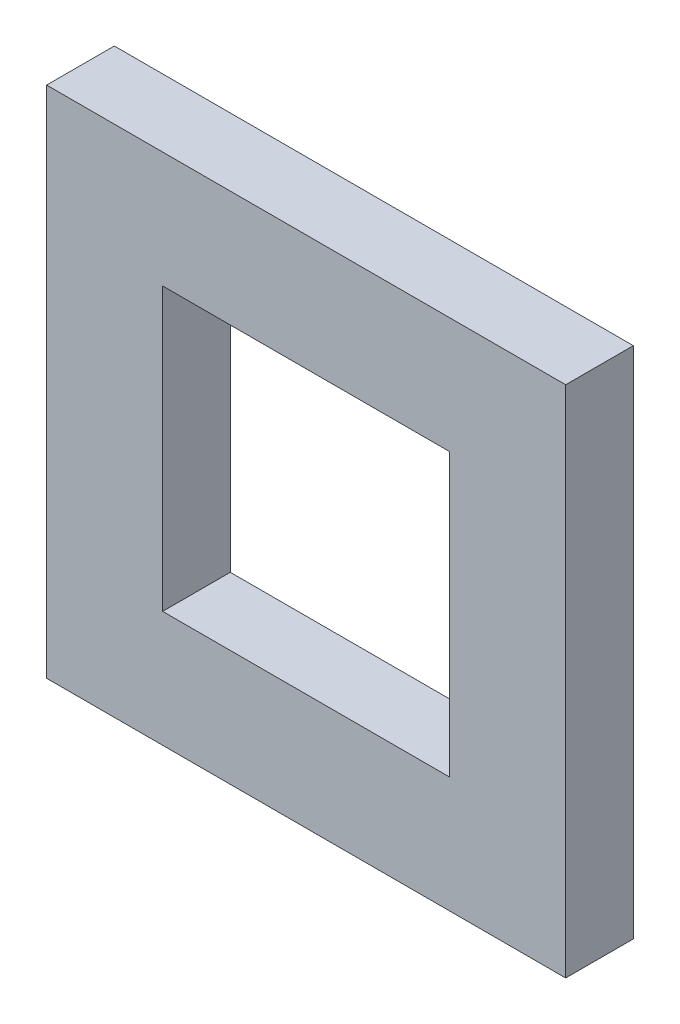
from build123d import *

# Parameters (mm, degrees)
SKETCH1_W           = 170.5102
SKETCH1_H           = 168.783
SKETCH1_W_2         = 94.3102
SKETCH1_H_2         = 92.583
BOSS_EXTRUDE1_DEPTH = 22.225


with BuildPart() as part:
    # Sketch1 → Boss-Extrude1 (new body)
    with BuildSketch(Plane.XY):
        Rectangle(SKETCH1_W, SKETCH1_H)
        Rectangle(SKETCH1_W_2, SKETCH1_H_2, mode=Mode.SUBTRACT)
    extrude(amount=BOSS_EXTRUDE1_DEPTH)


solid = part.part
